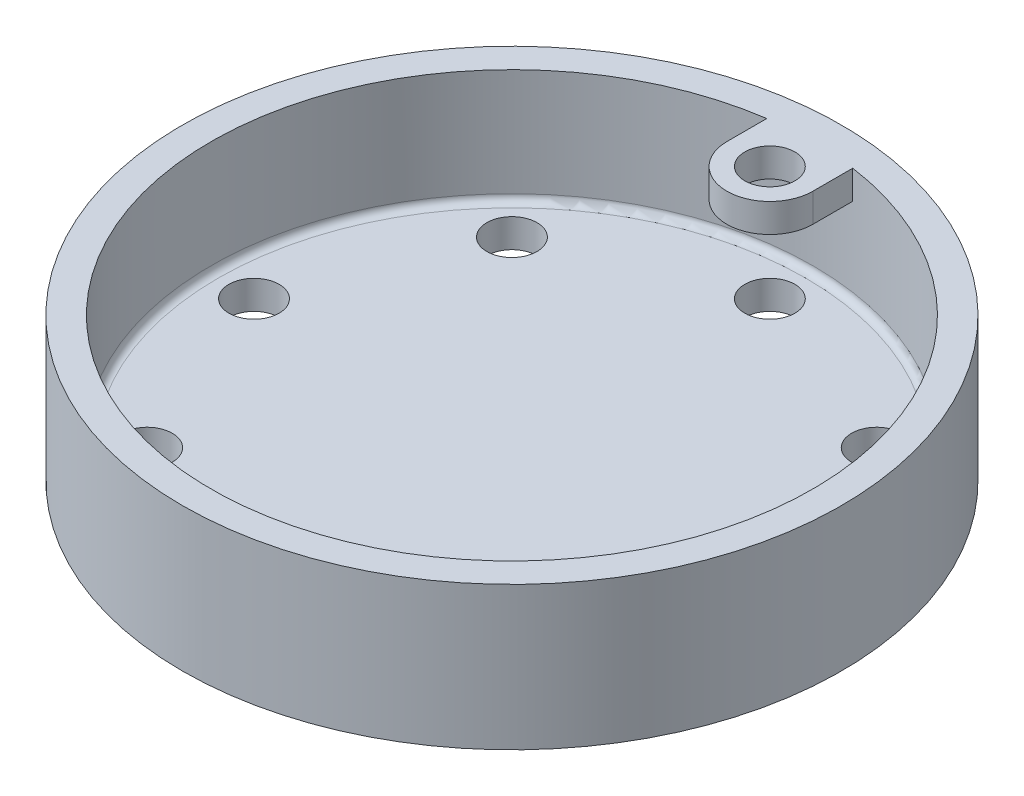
ISO-10303-21;
HEADER;
FILE_DESCRIPTION(('STEP AP214'),'2;1');
FILE_NAME('part.step','',(''),(''),'','','');
FILE_SCHEMA(('AUTOMOTIVE_DESIGN { 1 0 10303 214 1 1 1 1 }'));
ENDSEC;
DATA;
#1=APPLICATION_CONTEXT('core data for automotive mechanical design processes');
#2=APPLICATION_PROTOCOL_DEFINITION('international standard','automotive_design',2000,#1);
#3=PRODUCT_CONTEXT('',#1,'mechanical');
#4=PRODUCT('Part','Part','',(#3));
#5=PRODUCT_RELATED_PRODUCT_CATEGORY('part','',(#4));
#6=PRODUCT_DEFINITION_FORMATION('','',#4);
#7=PRODUCT_DEFINITION_CONTEXT('part definition',#1,'design');
#8=PRODUCT_DEFINITION('design','',#6,#7);
#9=PRODUCT_DEFINITION_SHAPE('','',#8);
#10=(LENGTH_UNIT() NAMED_UNIT(*) SI_UNIT(.MILLI.,.METRE.));
#11=(NAMED_UNIT(*) PLANE_ANGLE_UNIT() SI_UNIT($,.RADIAN.));
#12=(NAMED_UNIT(*) SI_UNIT($,.STERADIAN.) SOLID_ANGLE_UNIT());
#13=UNCERTAINTY_MEASURE_WITH_UNIT(LENGTH_MEASURE(1.E-05),#10,'distance_accuracy_value','');
#14=(GEOMETRIC_REPRESENTATION_CONTEXT(3) GLOBAL_UNCERTAINTY_ASSIGNED_CONTEXT((#13)) GLOBAL_UNIT_ASSIGNED_CONTEXT((#10,
#11,#12)) REPRESENTATION_CONTEXT('',''));
#15=CARTESIAN_POINT('',(0.,0.,0.));
#16=DIRECTION('',(0.,0.,1.));
#17=DIRECTION('',(1.,0.,0.));
#18=AXIS2_PLACEMENT_3D('',#15,#16,#17);
#19=CARTESIAN_POINT('',(0.,31.75,0.));
#20=DIRECTION('',(0.,-1.,0.));
#21=DIRECTION('',(0.,0.,-1.));
#22=AXIS2_PLACEMENT_3D('',#19,#20,#21);
#23=CYLINDRICAL_SURFACE('',#22,66.675);
#24=CARTESIAN_POINT('',(0.,7.9375,0.));
#25=DIRECTION('',(0.,1.,0.));
#26=DIRECTION('',(0.,0.,1.));
#27=AXIS2_PLACEMENT_3D('',#24,#25,#26);
#28=CIRCLE('',#27,66.675);
#29=CARTESIAN_POINT('',(0.,7.9375,66.675));
#30=VERTEX_POINT('',#29);
#31=EDGE_CURVE('E11',#30,#30,#28,.F.);
#32=ORIENTED_EDGE('',*,*,#31,.T.);
#33=EDGE_LOOP('',(#32));
#34=FACE_BOUND('',#33,.T.);
#35=CARTESIAN_POINT('',(0.,31.75,0.));
#36=DIRECTION('',(0.,1.,0.));
#37=DIRECTION('',(0.,0.,1.));
#38=AXIS2_PLACEMENT_3D('',#35,#36,#37);
#39=CIRCLE('',#38,66.675);
#40=CARTESIAN_POINT('',(-9.525,31.75,-65.9911357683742));
#41=VERTEX_POINT('',#40);
#42=CARTESIAN_POINT('',(9.525,31.75,-65.9911357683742));
#43=VERTEX_POINT('',#42);
#44=EDGE_CURVE('E69',#41,#43,#39,.T.);
#45=ORIENTED_EDGE('',*,*,#44,.T.);
#46=DIRECTION('',(0.,1.,0.));
#47=VECTOR('',#46,1.);
#48=CARTESIAN_POINT('',(9.525,25.4,-65.9911357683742));
#49=LINE('',#48,#47);
#50=CARTESIAN_POINT('',(9.525,25.4,-65.9911357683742));
#51=VERTEX_POINT('',#50);
#52=EDGE_CURVE('E48',#51,#43,#49,.T.);
#53=ORIENTED_EDGE('',*,*,#52,.F.);
#54=CARTESIAN_POINT('',(0.,25.4,0.));
#55=DIRECTION('',(0.,1.,0.));
#56=DIRECTION('',(0.,0.,1.));
#57=AXIS2_PLACEMENT_3D('',#54,#55,#56);
#58=CIRCLE('',#57,66.675);
#59=CARTESIAN_POINT('',(-9.525,25.4,-65.9911357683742));
#60=VERTEX_POINT('',#59);
#61=EDGE_CURVE('E43',#51,#60,#58,.T.);
#62=ORIENTED_EDGE('',*,*,#61,.T.);
#63=DIRECTION('',(0.,1.,0.));
#64=VECTOR('',#63,1.);
#65=CARTESIAN_POINT('',(-9.525,25.4,-65.9911357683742));
#66=LINE('',#65,#64);
#67=EDGE_CURVE('E79',#60,#41,#66,.T.);
#68=ORIENTED_EDGE('',*,*,#67,.T.);
#69=EDGE_LOOP('',(#45,#53,#62,#68));
#70=FACE_BOUND('',#69,.T.);
#71=ADVANCED_FACE('F28',(#34,#70),#23,.F.);
#72=CARTESIAN_POINT('',(0.,31.75,0.));
#73=DIRECTION('',(0.,-1.,0.));
#74=DIRECTION('',(0.,0.,-1.));
#75=AXIS2_PLACEMENT_3D('',#72,#73,#74);
#76=CYLINDRICAL_SURFACE('',#75,73.025);
#77=CARTESIAN_POINT('',(0.,31.75,0.));
#78=DIRECTION('',(0.,1.,0.));
#79=DIRECTION('',(0.,0.,1.));
#80=AXIS2_PLACEMENT_3D('',#77,#78,#79);
#81=CIRCLE('',#80,73.025);
#82=CARTESIAN_POINT('',(0.,31.75,73.025));
#83=VERTEX_POINT('',#82);
#84=EDGE_CURVE('E111',#83,#83,#81,.T.);
#85=ORIENTED_EDGE('',*,*,#84,.F.);
#86=EDGE_LOOP('',(#85));
#87=FACE_BOUND('',#86,.T.);
#88=CARTESIAN_POINT('',(0.,0.,0.));
#89=DIRECTION('',(0.,1.,0.));
#90=DIRECTION('',(0.,0.,1.));
#91=AXIS2_PLACEMENT_3D('',#88,#89,#90);
#92=CIRCLE('',#91,73.025);
#93=CARTESIAN_POINT('',(0.,0.,73.025));
#94=VERTEX_POINT('',#93);
#95=EDGE_CURVE('E76',#94,#94,#92,.T.);
#96=ORIENTED_EDGE('',*,*,#95,.T.);
#97=EDGE_LOOP('',(#96));
#98=FACE_BOUND('',#97,.T.);
#99=ADVANCED_FACE('F30',(#87,#98),#76,.T.);
#100=CARTESIAN_POINT('',(0.,31.75,0.));
#101=DIRECTION('',(0.,1.,0.));
#102=DIRECTION('',(0.,0.,1.));
#103=AXIS2_PLACEMENT_3D('',#100,#101,#102);
#104=PLANE('',#103);
#105=CARTESIAN_POINT('',(0.,31.75,-57.15));
#106=DIRECTION('',(0.,1.,0.));
#107=DIRECTION('',(0.,0.,1.));
#108=AXIS2_PLACEMENT_3D('',#105,#106,#107);
#109=CIRCLE('',#108,5.55625);
#110=CARTESIAN_POINT('',(0.,31.75,-51.59375));
#111=VERTEX_POINT('',#110);
#112=EDGE_CURVE('E93',#111,#111,#109,.T.);
#113=ORIENTED_EDGE('',*,*,#112,.F.);
#114=EDGE_LOOP('',(#113));
#115=FACE_BOUND('',#114,.T.);
#116=ORIENTED_EDGE('',*,*,#44,.F.);
#117=DIRECTION('',(0.,0.,-1.));
#118=VECTOR('',#117,1.);
#119=CARTESIAN_POINT('',(-9.525,31.75,-57.15));
#120=LINE('',#119,#118);
#121=CARTESIAN_POINT('',(-9.525,31.75,-57.15));
#122=VERTEX_POINT('',#121);
#123=EDGE_CURVE('E74',#122,#41,#120,.T.);
#124=ORIENTED_EDGE('',*,*,#123,.F.);
#125=CARTESIAN_POINT('',(0.,31.75,-57.15));
#126=DIRECTION('',(0.,-1.,0.));
#127=DIRECTION('',(0.,0.,-1.));
#128=AXIS2_PLACEMENT_3D('',#125,#126,#127);
#129=CIRCLE('',#128,9.525);
#130=CARTESIAN_POINT('',(9.525,31.75,-57.15));
#131=VERTEX_POINT('',#130);
#132=EDGE_CURVE('E88',#131,#122,#129,.T.);
#133=ORIENTED_EDGE('',*,*,#132,.F.);
#134=DIRECTION('',(0.,0.,1.));
#135=VECTOR('',#134,1.);
#136=CARTESIAN_POINT('',(9.525,31.75,-65.9911357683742));
#137=LINE('',#136,#135);
#138=EDGE_CURVE('E75',#43,#131,#137,.T.);
#139=ORIENTED_EDGE('',*,*,#138,.F.);
#140=EDGE_LOOP('',(#116,#124,#133,#139));
#141=FACE_BOUND('',#140,.T.);
#142=ORIENTED_EDGE('',*,*,#84,.T.);
#143=EDGE_LOOP('',(#142));
#144=FACE_BOUND('',#143,.T.);
#145=ADVANCED_FACE('F70',(#115,#141,#144),#104,.T.);
#146=CARTESIAN_POINT('',(0.,0.,0.));
#147=DIRECTION('',(0.,1.,0.));
#148=DIRECTION('',(0.,0.,1.));
#149=AXIS2_PLACEMENT_3D('',#146,#147,#148);
#150=PLANE('',#149);
#151=CARTESIAN_POINT('',(-40.4111525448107,0.,-40.4111525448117));
#152=DIRECTION('',(0.,1.,0.));
#153=DIRECTION('',(0.707106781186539,0.,0.707106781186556));
#154=AXIS2_PLACEMENT_3D('',#151,#152,#153);
#155=CIRCLE('',#154,5.55625);
#156=CARTESIAN_POINT('',(-36.482290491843,0.,-36.4822904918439));
#157=VERTEX_POINT('',#156);
#158=EDGE_CURVE('E199',#157,#157,#155,.T.);
#159=ORIENTED_EDGE('',*,*,#158,.T.);
#160=EDGE_LOOP('',(#159));
#161=FACE_BOUND('',#160,.T.);
#162=CARTESIAN_POINT('',(-57.15,0.,-5.98614822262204E-13));
#163=DIRECTION('',(0.,1.,0.));
#164=DIRECTION('',(1.,0.,0.));
#165=AXIS2_PLACEMENT_3D('',#162,#163,#164);
#166=CIRCLE('',#165,5.55625);
#167=CARTESIAN_POINT('',(-51.59375,0.,-5.40416158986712E-13));
#168=VERTEX_POINT('',#167);
#169=EDGE_CURVE('E193',#168,#168,#166,.T.);
#170=ORIENTED_EDGE('',*,*,#169,.T.);
#171=EDGE_LOOP('',(#170));
#172=FACE_BOUND('',#171,.T.);
#173=CARTESIAN_POINT('',(-40.4111525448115,0.,40.4111525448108));
#174=DIRECTION('',(0.,1.,0.));
#175=DIRECTION('',(0.707106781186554,0.,-0.707106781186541));
#176=AXIS2_PLACEMENT_3D('',#173,#174,#175);
#177=CIRCLE('',#176,5.55625);
#178=CARTESIAN_POINT('',(-40.4111525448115,0.,45.9674025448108));
#179=VERTEX_POINT('',#178);
#180=EDGE_CURVE('E187',#179,#179,#177,.T.);
#181=ORIENTED_EDGE('',*,*,#180,.T.);
#182=EDGE_LOOP('',(#181));
#183=FACE_BOUND('',#182,.T.);
#184=CARTESIAN_POINT('',(-3.99076548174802E-13,0.,57.15));
#185=DIRECTION('',(0.,1.,0.));
#186=DIRECTION('',(0.,0.,-1.));
#187=AXIS2_PLACEMENT_3D('',#184,#185,#186);
#188=CIRCLE('',#187,5.55625);
#189=CARTESIAN_POINT('',(-3.60277439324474E-13,0.,51.59375));
#190=VERTEX_POINT('',#189);
#191=EDGE_CURVE('E181',#190,#190,#188,.T.);
#192=ORIENTED_EDGE('',*,*,#191,.T.);
#193=EDGE_LOOP('',(#192));
#194=FACE_BOUND('',#193,.T.);
#195=CARTESIAN_POINT('',(40.411152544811,0.,40.4111525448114));
#196=DIRECTION('',(0.,1.,0.));
#197=DIRECTION('',(-0.707106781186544,0.,-0.707106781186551));
#198=AXIS2_PLACEMENT_3D('',#195,#196,#197);
#199=CIRCLE('',#198,5.55625);
#200=CARTESIAN_POINT('',(36.4822904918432,0.,36.4822904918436));
#201=VERTEX_POINT('',#200);
#202=EDGE_CURVE('E175',#201,#201,#199,.T.);
#203=ORIENTED_EDGE('',*,*,#202,.T.);
#204=EDGE_LOOP('',(#203));
#205=FACE_BOUND('',#204,.T.);
#206=CARTESIAN_POINT('',(57.15,0.,1.99538274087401E-13));
#207=DIRECTION('',(0.,1.,0.));
#208=DIRECTION('',(-1.,0.,0.));
#209=AXIS2_PLACEMENT_3D('',#206,#207,#208);
#210=CIRCLE('',#209,5.55625);
#211=CARTESIAN_POINT('',(51.59375,0.,1.80138719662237E-13));
#212=VERTEX_POINT('',#211);
#213=EDGE_CURVE('E169',#212,#212,#210,.T.);
#214=ORIENTED_EDGE('',*,*,#213,.T.);
#215=EDGE_LOOP('',(#214));
#216=FACE_BOUND('',#215,.T.);
#217=CARTESIAN_POINT('',(40.4111525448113,0.,-40.4111525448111));
#218=DIRECTION('',(0.,1.,0.));
#219=DIRECTION('',(-0.707106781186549,0.,0.707106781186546));
#220=AXIS2_PLACEMENT_3D('',#217,#218,#219);
#221=CIRCLE('',#220,5.55625);
#222=CARTESIAN_POINT('',(36.4822904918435,0.,-36.4822904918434));
#223=VERTEX_POINT('',#222);
#224=EDGE_CURVE('E163',#223,#223,#221,.T.);
#225=ORIENTED_EDGE('',*,*,#224,.T.);
#226=EDGE_LOOP('',(#225));
#227=FACE_BOUND('',#226,.T.);
#228=CARTESIAN_POINT('',(0.,0.,-57.15));
#229=DIRECTION('',(0.,1.,0.));
#230=DIRECTION('',(0.,0.,1.));
#231=AXIS2_PLACEMENT_3D('',#228,#229,#230);
#232=CIRCLE('',#231,5.55625);
#233=CARTESIAN_POINT('',(0.,0.,-51.59375));
#234=VERTEX_POINT('',#233);
#235=EDGE_CURVE('E156',#234,#234,#232,.T.);
#236=ORIENTED_EDGE('',*,*,#235,.T.);
#237=EDGE_LOOP('',(#236));
#238=FACE_BOUND('',#237,.T.);
#239=ORIENTED_EDGE('',*,*,#95,.F.);
#240=EDGE_LOOP('',(#239));
#241=FACE_BOUND('',#240,.T.);
#242=ADVANCED_FACE('F144',(#161,#172,#183,#194,#205,#216,#227,#238,#241),#150,.F.);
#243=CARTESIAN_POINT('',(0.,6.35,0.));
#244=DIRECTION('',(0.,1.,0.));
#245=DIRECTION('',(0.,0.,1.));
#246=AXIS2_PLACEMENT_3D('',#243,#244,#245);
#247=PLANE('',#246);
#248=CARTESIAN_POINT('',(0.,6.35,0.));
#249=DIRECTION('',(0.,1.,0.));
#250=DIRECTION('',(0.,0.,1.));
#251=AXIS2_PLACEMENT_3D('',#248,#249,#250);
#252=CIRCLE('',#251,65.0875);
#253=CARTESIAN_POINT('',(0.,6.35,65.0875));
#254=VERTEX_POINT('',#253);
#255=EDGE_CURVE('E36',#254,#254,#252,.T.);
#256=ORIENTED_EDGE('',*,*,#255,.T.);
#257=EDGE_LOOP('',(#256));
#258=FACE_BOUND('',#257,.T.);
#259=CARTESIAN_POINT('',(-40.4111525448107,6.35,-40.4111525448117));
#260=DIRECTION('',(0.,1.,0.));
#261=DIRECTION('',(0.707106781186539,0.,0.707106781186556));
#262=AXIS2_PLACEMENT_3D('',#259,#260,#261);
#263=CIRCLE('',#262,5.55625);
#264=CARTESIAN_POINT('',(-36.482290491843,6.35,-36.4822904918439));
#265=VERTEX_POINT('',#264);
#266=EDGE_CURVE('E202',#265,#265,#263,.T.);
#267=ORIENTED_EDGE('',*,*,#266,.F.);
#268=EDGE_LOOP('',(#267));
#269=FACE_BOUND('',#268,.T.);
#270=CARTESIAN_POINT('',(-57.15,6.35,-5.98614822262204E-13));
#271=DIRECTION('',(0.,1.,0.));
#272=DIRECTION('',(1.,0.,0.));
#273=AXIS2_PLACEMENT_3D('',#270,#271,#272);
#274=CIRCLE('',#273,5.55625);
#275=CARTESIAN_POINT('',(-51.59375,6.35,-5.40416158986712E-13));
#276=VERTEX_POINT('',#275);
#277=EDGE_CURVE('E196',#276,#276,#274,.T.);
#278=ORIENTED_EDGE('',*,*,#277,.F.);
#279=EDGE_LOOP('',(#278));
#280=FACE_BOUND('',#279,.T.);
#281=CARTESIAN_POINT('',(-40.4111525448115,6.35,40.4111525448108));
#282=DIRECTION('',(0.,1.,0.));
#283=DIRECTION('',(0.707106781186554,0.,-0.707106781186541));
#284=AXIS2_PLACEMENT_3D('',#281,#282,#283);
#285=CIRCLE('',#284,5.55625);
#286=CARTESIAN_POINT('',(-40.4111525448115,6.35,45.9674025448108));
#287=VERTEX_POINT('',#286);
#288=EDGE_CURVE('E190',#287,#287,#285,.T.);
#289=ORIENTED_EDGE('',*,*,#288,.F.);
#290=EDGE_LOOP('',(#289));
#291=FACE_BOUND('',#290,.T.);
#292=CARTESIAN_POINT('',(-3.99076548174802E-13,6.35,57.15));
#293=DIRECTION('',(0.,1.,0.));
#294=DIRECTION('',(0.,0.,-1.));
#295=AXIS2_PLACEMENT_3D('',#292,#293,#294);
#296=CIRCLE('',#295,5.55625);
#297=CARTESIAN_POINT('',(-3.60277439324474E-13,6.35,51.59375));
#298=VERTEX_POINT('',#297);
#299=EDGE_CURVE('E184',#298,#298,#296,.T.);
#300=ORIENTED_EDGE('',*,*,#299,.F.);
#301=EDGE_LOOP('',(#300));
#302=FACE_BOUND('',#301,.T.);
#303=CARTESIAN_POINT('',(40.411152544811,6.35,40.4111525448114));
#304=DIRECTION('',(0.,1.,0.));
#305=DIRECTION('',(-0.707106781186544,0.,-0.707106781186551));
#306=AXIS2_PLACEMENT_3D('',#303,#304,#305);
#307=CIRCLE('',#306,5.55625);
#308=CARTESIAN_POINT('',(36.4822904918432,6.35,36.4822904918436));
#309=VERTEX_POINT('',#308);
#310=EDGE_CURVE('E178',#309,#309,#307,.T.);
#311=ORIENTED_EDGE('',*,*,#310,.F.);
#312=EDGE_LOOP('',(#311));
#313=FACE_BOUND('',#312,.T.);
#314=CARTESIAN_POINT('',(57.15,6.35,1.99538274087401E-13));
#315=DIRECTION('',(0.,1.,0.));
#316=DIRECTION('',(-1.,0.,0.));
#317=AXIS2_PLACEMENT_3D('',#314,#315,#316);
#318=CIRCLE('',#317,5.55625);
#319=CARTESIAN_POINT('',(51.59375,6.35,1.80138719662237E-13));
#320=VERTEX_POINT('',#319);
#321=EDGE_CURVE('E172',#320,#320,#318,.T.);
#322=ORIENTED_EDGE('',*,*,#321,.F.);
#323=EDGE_LOOP('',(#322));
#324=FACE_BOUND('',#323,.T.);
#325=CARTESIAN_POINT('',(40.4111525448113,6.35,-40.4111525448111));
#326=DIRECTION('',(0.,1.,0.));
#327=DIRECTION('',(-0.707106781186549,0.,0.707106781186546));
#328=AXIS2_PLACEMENT_3D('',#325,#326,#327);
#329=CIRCLE('',#328,5.55625);
#330=CARTESIAN_POINT('',(36.4822904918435,6.35,-36.4822904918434));
#331=VERTEX_POINT('',#330);
#332=EDGE_CURVE('E166',#331,#331,#329,.T.);
#333=ORIENTED_EDGE('',*,*,#332,.F.);
#334=EDGE_LOOP('',(#333));
#335=FACE_BOUND('',#334,.T.);
#336=CARTESIAN_POINT('',(0.,6.35,-57.15));
#337=DIRECTION('',(0.,1.,0.));
#338=DIRECTION('',(0.,0.,1.));
#339=AXIS2_PLACEMENT_3D('',#336,#337,#338);
#340=CIRCLE('',#339,5.55625);
#341=CARTESIAN_POINT('',(0.,6.35,-51.59375));
#342=VERTEX_POINT('',#341);
#343=EDGE_CURVE('E158',#342,#342,#340,.T.);
#344=ORIENTED_EDGE('',*,*,#343,.F.);
#345=EDGE_LOOP('',(#344));
#346=FACE_BOUND('',#345,.T.);
#347=ADVANCED_FACE('F116',(#258,#269,#280,#291,#302,#313,#324,#335,#346),#247,.T.);
#348=CARTESIAN_POINT('',(9.525,25.4,-65.9911357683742));
#349=DIRECTION('',(-1.,0.,0.));
#350=DIRECTION('',(0.,0.,1.));
#351=AXIS2_PLACEMENT_3D('',#348,#349,#350);
#352=PLANE('',#351);
#353=ORIENTED_EDGE('',*,*,#138,.T.);
#354=DIRECTION('',(0.,1.,0.));
#355=VECTOR('',#354,1.);
#356=CARTESIAN_POINT('',(9.525,25.4,-57.15));
#357=LINE('',#356,#355);
#358=CARTESIAN_POINT('',(9.525,25.4,-57.15));
#359=VERTEX_POINT('',#358);
#360=EDGE_CURVE('E105',#359,#131,#357,.T.);
#361=ORIENTED_EDGE('',*,*,#360,.F.);
#362=DIRECTION('',(0.,0.,1.));
#363=VECTOR('',#362,1.);
#364=CARTESIAN_POINT('',(9.525,25.4,-65.9911357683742));
#365=LINE('',#364,#363);
#366=EDGE_CURVE('E83',#51,#359,#365,.T.);
#367=ORIENTED_EDGE('',*,*,#366,.F.);
#368=ORIENTED_EDGE('',*,*,#52,.T.);
#369=EDGE_LOOP('',(#353,#361,#367,#368));
#370=FACE_BOUND('',#369,.T.);
#371=ADVANCED_FACE('F143',(#370),#352,.F.);
#372=CARTESIAN_POINT('',(0.,25.4,-57.15));
#373=DIRECTION('',(0.,1.,0.));
#374=DIRECTION('',(0.,0.,1.));
#375=AXIS2_PLACEMENT_3D('',#372,#373,#374);
#376=CYLINDRICAL_SURFACE('',#375,9.525);
#377=ORIENTED_EDGE('',*,*,#132,.T.);
#378=DIRECTION('',(0.,1.,0.));
#379=VECTOR('',#378,1.);
#380=CARTESIAN_POINT('',(-9.525,25.4,-57.15));
#381=LINE('',#380,#379);
#382=CARTESIAN_POINT('',(-9.525,25.4,-57.15));
#383=VERTEX_POINT('',#382);
#384=EDGE_CURVE('E82',#383,#122,#381,.T.);
#385=ORIENTED_EDGE('',*,*,#384,.F.);
#386=CARTESIAN_POINT('',(0.,25.4,-57.15));
#387=DIRECTION('',(0.,-1.,0.));
#388=DIRECTION('',(0.,0.,-1.));
#389=AXIS2_PLACEMENT_3D('',#386,#387,#388);
#390=CIRCLE('',#389,9.525);
#391=EDGE_CURVE('E101',#359,#383,#390,.T.);
#392=ORIENTED_EDGE('',*,*,#391,.F.);
#393=ORIENTED_EDGE('',*,*,#360,.T.);
#394=EDGE_LOOP('',(#377,#385,#392,#393));
#395=FACE_BOUND('',#394,.T.);
#396=ADVANCED_FACE('F242',(#395),#376,.T.);
#397=CARTESIAN_POINT('',(-9.525,25.4,-57.15));
#398=DIRECTION('',(1.,0.,0.));
#399=DIRECTION('',(0.,0.,-1.));
#400=AXIS2_PLACEMENT_3D('',#397,#398,#399);
#401=PLANE('',#400);
#402=ORIENTED_EDGE('',*,*,#123,.T.);
#403=ORIENTED_EDGE('',*,*,#67,.F.);
#404=DIRECTION('',(0.,0.,-1.));
#405=VECTOR('',#404,1.);
#406=CARTESIAN_POINT('',(-9.525,25.4,-57.15));
#407=LINE('',#406,#405);
#408=EDGE_CURVE('E99',#383,#60,#407,.T.);
#409=ORIENTED_EDGE('',*,*,#408,.F.);
#410=ORIENTED_EDGE('',*,*,#384,.T.);
#411=EDGE_LOOP('',(#402,#403,#409,#410));
#412=FACE_BOUND('',#411,.T.);
#413=ADVANCED_FACE('F86',(#412),#401,.F.);
#414=CARTESIAN_POINT('',(0.,25.4,0.));
#415=DIRECTION('',(0.,1.,0.));
#416=DIRECTION('',(0.,0.,1.));
#417=AXIS2_PLACEMENT_3D('',#414,#415,#416);
#418=PLANE('',#417);
#419=CARTESIAN_POINT('',(0.,25.4,-57.15));
#420=DIRECTION('',(0.,1.,0.));
#421=DIRECTION('',(0.,0.,1.));
#422=AXIS2_PLACEMENT_3D('',#419,#420,#421);
#423=CIRCLE('',#422,5.55625);
#424=CARTESIAN_POINT('',(0.,25.4,-51.59375));
#425=VERTEX_POINT('',#424);
#426=EDGE_CURVE('E89',#425,#425,#423,.F.);
#427=ORIENTED_EDGE('',*,*,#426,.F.);
#428=EDGE_LOOP('',(#427));
#429=FACE_BOUND('',#428,.T.);
#430=ORIENTED_EDGE('',*,*,#61,.F.);
#431=ORIENTED_EDGE('',*,*,#366,.T.);
#432=ORIENTED_EDGE('',*,*,#391,.T.);
#433=ORIENTED_EDGE('',*,*,#408,.T.);
#434=EDGE_LOOP('',(#430,#431,#432,#433));
#435=FACE_BOUND('',#434,.T.);
#436=ADVANCED_FACE('F234',(#429,#435),#418,.F.);
#437=CARTESIAN_POINT('',(0.,-0.001000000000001,-57.15));
#438=DIRECTION('',(0.,1.,0.));
#439=DIRECTION('',(0.,0.,1.));
#440=AXIS2_PLACEMENT_3D('',#437,#438,#439);
#441=CYLINDRICAL_SURFACE('',#440,5.55625);
#442=ORIENTED_EDGE('',*,*,#112,.T.);
#443=EDGE_LOOP('',(#442));
#444=FACE_BOUND('',#443,.T.);
#445=ORIENTED_EDGE('',*,*,#426,.T.);
#446=EDGE_LOOP('',(#445));
#447=FACE_BOUND('',#446,.T.);
#448=ADVANCED_FACE('F224',(#444,#447),#441,.F.);
#449=CARTESIAN_POINT('',(0.,0.,-57.15));
#450=DIRECTION('',(0.,1.,0.));
#451=DIRECTION('',(0.,0.,1.));
#452=AXIS2_PLACEMENT_3D('',#449,#450,#451);
#453=CYLINDRICAL_SURFACE('',#452,5.55625);
#454=ORIENTED_EDGE('',*,*,#235,.F.);
#455=EDGE_LOOP('',(#454));
#456=FACE_BOUND('',#455,.T.);
#457=ORIENTED_EDGE('',*,*,#343,.T.);
#458=EDGE_LOOP('',(#457));
#459=FACE_BOUND('',#458,.T.);
#460=ADVANCED_FACE('F221',(#456,#459),#453,.F.);
#461=CARTESIAN_POINT('',(40.4111525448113,0.,-40.4111525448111));
#462=DIRECTION('',(0.,1.,0.));
#463=DIRECTION('',(0.,0.,1.));
#464=AXIS2_PLACEMENT_3D('',#461,#462,#463);
#465=CYLINDRICAL_SURFACE('',#464,5.55625);
#466=ORIENTED_EDGE('',*,*,#224,.F.);
#467=EDGE_LOOP('',(#466));
#468=FACE_BOUND('',#467,.T.);
#469=ORIENTED_EDGE('',*,*,#332,.T.);
#470=EDGE_LOOP('',(#469));
#471=FACE_BOUND('',#470,.T.);
#472=ADVANCED_FACE('F223',(#468,#471),#465,.F.);
#473=CARTESIAN_POINT('',(57.15,0.,1.99538274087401E-13));
#474=DIRECTION('',(0.,1.,0.));
#475=DIRECTION('',(0.,0.,1.));
#476=AXIS2_PLACEMENT_3D('',#473,#474,#475);
#477=CYLINDRICAL_SURFACE('',#476,5.55625);
#478=ORIENTED_EDGE('',*,*,#213,.F.);
#479=EDGE_LOOP('',(#478));
#480=FACE_BOUND('',#479,.T.);
#481=ORIENTED_EDGE('',*,*,#321,.T.);
#482=EDGE_LOOP('',(#481));
#483=FACE_BOUND('',#482,.T.);
#484=ADVANCED_FACE('F231',(#480,#483),#477,.F.);
#485=CARTESIAN_POINT('',(40.411152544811,0.,40.4111525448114));
#486=DIRECTION('',(0.,1.,0.));
#487=DIRECTION('',(0.,0.,1.));
#488=AXIS2_PLACEMENT_3D('',#485,#486,#487);
#489=CYLINDRICAL_SURFACE('',#488,5.55625);
#490=ORIENTED_EDGE('',*,*,#202,.F.);
#491=EDGE_LOOP('',(#490));
#492=FACE_BOUND('',#491,.T.);
#493=ORIENTED_EDGE('',*,*,#310,.T.);
#494=EDGE_LOOP('',(#493));
#495=FACE_BOUND('',#494,.T.);
#496=ADVANCED_FACE('F277',(#492,#495),#489,.F.);
#497=CARTESIAN_POINT('',(-3.99076548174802E-13,0.,57.15));
#498=DIRECTION('',(0.,1.,0.));
#499=DIRECTION('',(0.,0.,1.));
#500=AXIS2_PLACEMENT_3D('',#497,#498,#499);
#501=CYLINDRICAL_SURFACE('',#500,5.55625);
#502=ORIENTED_EDGE('',*,*,#191,.F.);
#503=EDGE_LOOP('',(#502));
#504=FACE_BOUND('',#503,.T.);
#505=ORIENTED_EDGE('',*,*,#299,.T.);
#506=EDGE_LOOP('',(#505));
#507=FACE_BOUND('',#506,.T.);
#508=ADVANCED_FACE('F284',(#504,#507),#501,.F.);
#509=CARTESIAN_POINT('',(-40.4111525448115,0.,40.4111525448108));
#510=DIRECTION('',(0.,1.,0.));
#511=DIRECTION('',(0.,0.,1.));
#512=AXIS2_PLACEMENT_3D('',#509,#510,#511);
#513=CYLINDRICAL_SURFACE('',#512,5.55625);
#514=CARTESIAN_POINT('',(-40.4111525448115,0.,45.9674025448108));
#515=CARTESIAN_POINT('',(-40.4111525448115,0.0661458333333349,45.9674025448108));
#516=CARTESIAN_POINT('',(-40.4111525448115,0.132291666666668,45.9674025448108));
#517=CARTESIAN_POINT('',(-40.4111525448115,0.264583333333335,45.9674025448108));
#518=CARTESIAN_POINT('',(-40.4111525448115,0.330729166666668,45.9674025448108));
#519=CARTESIAN_POINT('',(-40.4111525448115,0.463020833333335,45.9674025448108));
#520=CARTESIAN_POINT('',(-40.4111525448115,0.529166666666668,45.9674025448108));
#521=CARTESIAN_POINT('',(-40.4111525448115,0.661458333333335,45.9674025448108));
#522=CARTESIAN_POINT('',(-40.4111525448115,0.727604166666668,45.9674025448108));
#523=CARTESIAN_POINT('',(-40.4111525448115,0.859895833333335,45.9674025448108));
#524=CARTESIAN_POINT('',(-40.4111525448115,0.926041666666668,45.9674025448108));
#525=CARTESIAN_POINT('',(-40.4111525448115,1.05833333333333,45.9674025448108));
#526=CARTESIAN_POINT('',(-40.4111525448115,1.12447916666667,45.9674025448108));
#527=CARTESIAN_POINT('',(-40.4111525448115,1.25677083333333,45.9674025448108));
#528=CARTESIAN_POINT('',(-40.4111525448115,1.32291666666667,45.9674025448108));
#529=CARTESIAN_POINT('',(-40.4111525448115,1.45520833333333,45.9674025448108));
#530=CARTESIAN_POINT('',(-40.4111525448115,1.52135416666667,45.9674025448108));
#531=CARTESIAN_POINT('',(-40.4111525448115,1.65364583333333,45.9674025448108));
#532=CARTESIAN_POINT('',(-40.4111525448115,1.71979166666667,45.9674025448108));
#533=CARTESIAN_POINT('',(-40.4111525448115,1.85208333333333,45.9674025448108));
#534=CARTESIAN_POINT('',(-40.4111525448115,1.91822916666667,45.9674025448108));
#535=CARTESIAN_POINT('',(-40.4111525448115,2.05052083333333,45.9674025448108));
#536=CARTESIAN_POINT('',(-40.4111525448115,2.11666666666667,45.9674025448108));
#537=CARTESIAN_POINT('',(-40.4111525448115,2.24895833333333,45.9674025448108));
#538=CARTESIAN_POINT('',(-40.4111525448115,2.31510416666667,45.9674025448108));
#539=CARTESIAN_POINT('',(-40.4111525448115,2.44739583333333,45.9674025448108));
#540=CARTESIAN_POINT('',(-40.4111525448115,2.51354166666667,45.9674025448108));
#541=CARTESIAN_POINT('',(-40.4111525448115,2.64583333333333,45.9674025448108));
#542=CARTESIAN_POINT('',(-40.4111525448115,2.71197916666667,45.9674025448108));
#543=CARTESIAN_POINT('',(-40.4111525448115,2.84427083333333,45.9674025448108));
#544=CARTESIAN_POINT('',(-40.4111525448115,2.91041666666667,45.9674025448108));
#545=CARTESIAN_POINT('',(-40.4111525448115,3.04270833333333,45.9674025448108));
#546=CARTESIAN_POINT('',(-40.4111525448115,3.10885416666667,45.9674025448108));
#547=CARTESIAN_POINT('',(-40.4111525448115,3.24114583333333,45.9674025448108));
#548=CARTESIAN_POINT('',(-40.4111525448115,3.30729166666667,45.9674025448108));
#549=CARTESIAN_POINT('',(-40.4111525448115,3.43958333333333,45.9674025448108));
#550=CARTESIAN_POINT('',(-40.4111525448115,3.50572916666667,45.9674025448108));
#551=CARTESIAN_POINT('',(-40.4111525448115,3.63802083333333,45.9674025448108));
#552=CARTESIAN_POINT('',(-40.4111525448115,3.70416666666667,45.9674025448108));
#553=CARTESIAN_POINT('',(-40.4111525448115,3.83645833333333,45.9674025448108));
#554=CARTESIAN_POINT('',(-40.4111525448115,3.90260416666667,45.9674025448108));
#555=CARTESIAN_POINT('',(-40.4111525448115,4.03489583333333,45.9674025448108));
#556=CARTESIAN_POINT('',(-40.4111525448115,4.10104166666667,45.9674025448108));
#557=CARTESIAN_POINT('',(-40.4111525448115,4.23333333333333,45.9674025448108));
#558=CARTESIAN_POINT('',(-40.4111525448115,4.29947916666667,45.9674025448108));
#559=CARTESIAN_POINT('',(-40.4111525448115,4.43177083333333,45.9674025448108));
#560=CARTESIAN_POINT('',(-40.4111525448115,4.49791666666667,45.9674025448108));
#561=CARTESIAN_POINT('',(-40.4111525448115,4.63020833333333,45.9674025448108));
#562=CARTESIAN_POINT('',(-40.4111525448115,4.69635416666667,45.9674025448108));
#563=CARTESIAN_POINT('',(-40.4111525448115,4.82864583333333,45.9674025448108));
#564=CARTESIAN_POINT('',(-40.4111525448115,4.89479166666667,45.9674025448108));
#565=CARTESIAN_POINT('',(-40.4111525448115,5.02708333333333,45.9674025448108));
#566=CARTESIAN_POINT('',(-40.4111525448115,5.09322916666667,45.9674025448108));
#567=CARTESIAN_POINT('',(-40.4111525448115,5.22552083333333,45.9674025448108));
#568=CARTESIAN_POINT('',(-40.4111525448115,5.29166666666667,45.9674025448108));
#569=CARTESIAN_POINT('',(-40.4111525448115,5.42395833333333,45.9674025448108));
#570=CARTESIAN_POINT('',(-40.4111525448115,5.49010416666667,45.9674025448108));
#571=CARTESIAN_POINT('',(-40.4111525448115,5.62239583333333,45.9674025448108));
#572=CARTESIAN_POINT('',(-40.4111525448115,5.68854166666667,45.9674025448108));
#573=CARTESIAN_POINT('',(-40.4111525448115,5.82083333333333,45.9674025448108));
#574=CARTESIAN_POINT('',(-40.4111525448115,5.88697916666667,45.9674025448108));
#575=CARTESIAN_POINT('',(-40.4111525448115,6.01927083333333,45.9674025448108));
#576=CARTESIAN_POINT('',(-40.4111525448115,6.08541666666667,45.9674025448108));
#577=CARTESIAN_POINT('',(-40.4111525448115,6.21770833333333,45.9674025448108));
#578=CARTESIAN_POINT('',(-40.4111525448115,6.28385416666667,45.9674025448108));
#579=CARTESIAN_POINT('',(-40.4111525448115,6.35,45.9674025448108));
#580=B_SPLINE_CURVE_WITH_KNOTS('',3,(#514,#515,#516,#517,#518,#519,#520,#521,#522,#523,#524,
#525,#526,#527,#528,#529,#530,#531,#532,#533,#534,#535,#536,#537,#538,#539,#540,#541,#542,#543,
#544,#545,#546,#547,#548,#549,#550,#551,#552,#553,#554,#555,#556,#557,#558,#559,#560,#561,#562,
#563,#564,#565,#566,#567,#568,#569,#570,#571,#572,#573,#574,#575,#576,#577,#578,#579),
.UNSPECIFIED.,.F.,.F.,(4,2,2,2,2,2,2,2,2,2,2,2,2,2,2,2,2,2,2,2,2,2,2,2,2,2,2,2,2,2,2,2,4),(0.,
0.1984375,0.396875,0.5953125,0.79375,0.992187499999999,1.190625,1.3890625,1.5875,1.7859375,
1.984375,2.1828125,2.38125,2.5796875,2.778125,2.9765625,3.175,3.3734375,3.571875,3.7703125,
3.96875,4.1671875,4.365625,4.5640625,4.7625,4.9609375,5.159375,5.3578125,5.55625,5.7546875,
5.953125,6.1515625,6.35),.UNSPECIFIED.);
#581=EDGE_CURVE('BSEAM292',#179,#287,#580,.T.);
#582=ORIENTED_EDGE('',*,*,#180,.F.);
#583=ORIENTED_EDGE('',*,*,#288,.T.);
#584=ORIENTED_EDGE('',*,*,#581,.T.);
#585=ORIENTED_EDGE('',*,*,#581,.F.);
#586=EDGE_LOOP('',(#582,#584,#583,#585));
#587=FACE_BOUND('',#586,.T.);
#588=ADVANCED_FACE('F292',(#587),#513,.F.);
#589=CARTESIAN_POINT('',(-57.15,0.,-5.98614822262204E-13));
#590=DIRECTION('',(0.,1.,0.));
#591=DIRECTION('',(0.,0.,1.));
#592=AXIS2_PLACEMENT_3D('',#589,#590,#591);
#593=CYLINDRICAL_SURFACE('',#592,5.55625);
#594=ORIENTED_EDGE('',*,*,#169,.F.);
#595=EDGE_LOOP('',(#594));
#596=FACE_BOUND('',#595,.T.);
#597=ORIENTED_EDGE('',*,*,#277,.T.);
#598=EDGE_LOOP('',(#597));
#599=FACE_BOUND('',#598,.T.);
#600=ADVANCED_FACE('F128',(#596,#599),#593,.F.);
#601=CARTESIAN_POINT('',(-40.4111525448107,0.,-40.4111525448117));
#602=DIRECTION('',(0.,1.,0.));
#603=DIRECTION('',(0.,0.,1.));
#604=AXIS2_PLACEMENT_3D('',#601,#602,#603);
#605=CYLINDRICAL_SURFACE('',#604,5.55625);
#606=ORIENTED_EDGE('',*,*,#158,.F.);
#607=EDGE_LOOP('',(#606));
#608=FACE_BOUND('',#607,.T.);
#609=ORIENTED_EDGE('',*,*,#266,.T.);
#610=EDGE_LOOP('',(#609));
#611=FACE_BOUND('',#610,.T.);
#612=ADVANCED_FACE('F121',(#608,#611),#605,.F.);
#613=CARTESIAN_POINT('',(0.,7.9375,0.));
#614=DIRECTION('',(0.,1.,0.));
#615=DIRECTION('',(0.,0.,1.));
#616=AXIS2_PLACEMENT_3D('',#613,#614,#615);
#617=TOROIDAL_SURFACE('',#616,65.0875,1.5875);
#618=ORIENTED_EDGE('',*,*,#31,.F.);
#619=EDGE_LOOP('',(#618));
#620=FACE_BOUND('',#619,.T.);
#621=ORIENTED_EDGE('',*,*,#255,.F.);
#622=EDGE_LOOP('',(#621));
#623=FACE_BOUND('',#622,.T.);
#624=ADVANCED_FACE('F119',(#620,#623),#617,.F.);
#625=CLOSED_SHELL('',(#71,#99,#145,#242,#347,#371,#396,#413,#436,#448,#460,#472,#484,#496,#508,
#588,#600,#612,#624));
#626=MANIFOLD_SOLID_BREP('B2',#625);
#627=ADVANCED_BREP_SHAPE_REPRESENTATION('',(#18,#626),#14);
#628=SHAPE_DEFINITION_REPRESENTATION(#9,#627);
ENDSEC;
END-ISO-10303-21;
